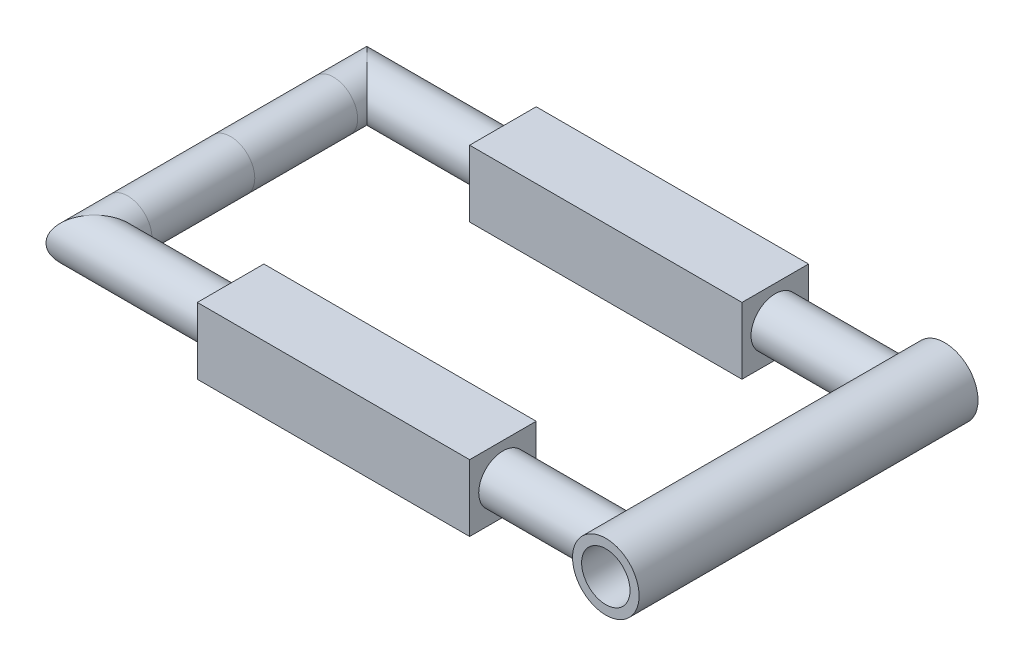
ISO-10303-21;
HEADER;
FILE_DESCRIPTION(('STEP AP214'),'2;1');
FILE_NAME('part.step','',(''),(''),'','','');
FILE_SCHEMA(('AUTOMOTIVE_DESIGN { 1 0 10303 214 1 1 1 1 }'));
ENDSEC;
DATA;
#1=APPLICATION_CONTEXT('core data for automotive mechanical design processes');
#2=APPLICATION_PROTOCOL_DEFINITION('international standard','automotive_design',2000,#1);
#3=PRODUCT_CONTEXT('',#1,'mechanical');
#4=PRODUCT('Part','Part','',(#3));
#5=PRODUCT_RELATED_PRODUCT_CATEGORY('part','',(#4));
#6=PRODUCT_DEFINITION_FORMATION('','',#4);
#7=PRODUCT_DEFINITION_CONTEXT('part definition',#1,'design');
#8=PRODUCT_DEFINITION('design','',#6,#7);
#9=PRODUCT_DEFINITION_SHAPE('','',#8);
#10=(LENGTH_UNIT() NAMED_UNIT(*) SI_UNIT(.MILLI.,.METRE.));
#11=(NAMED_UNIT(*) PLANE_ANGLE_UNIT() SI_UNIT($,.RADIAN.));
#12=(NAMED_UNIT(*) SI_UNIT($,.STERADIAN.) SOLID_ANGLE_UNIT());
#13=UNCERTAINTY_MEASURE_WITH_UNIT(LENGTH_MEASURE(1.E-05),#10,'distance_accuracy_value','');
#14=(GEOMETRIC_REPRESENTATION_CONTEXT(3) GLOBAL_UNCERTAINTY_ASSIGNED_CONTEXT((#13)) GLOBAL_UNIT_ASSIGNED_CONTEXT((#10,
#11,#12)) REPRESENTATION_CONTEXT('',''));
#15=CARTESIAN_POINT('',(0.,0.,0.));
#16=DIRECTION('',(0.,0.,1.));
#17=DIRECTION('',(1.,0.,0.));
#18=AXIS2_PLACEMENT_3D('',#15,#16,#17);
#19=CARTESIAN_POINT('',(-22.452,0.,114.3));
#20=DIRECTION('',(1.,0.,0.));
#21=DIRECTION('',(0.,0.,-1.));
#22=AXIS2_PLACEMENT_3D('',#19,#20,#21);
#23=CYLINDRICAL_SURFACE('',#22,20.32);
#24=CARTESIAN_POINT('',(0.,0.,114.3));
#25=DIRECTION('',(0.707106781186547,0.,0.707106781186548));
#26=DIRECTION('',(-0.707106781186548,0.,0.707106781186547));
#27=AXIS2_PLACEMENT_3D('',#24,#25,#26);
#28=ELLIPSE('',#27,28.7368195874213,20.32);
#29=CARTESIAN_POINT('',(-20.32,0.,134.62));
#30=VERTEX_POINT('',#29);
#31=EDGE_CURVE('E211',#30,#30,#28,.F.);
#32=ORIENTED_EDGE('',*,*,#31,.F.);
#33=EDGE_LOOP('',(#32));
#34=FACE_BOUND('',#33,.T.);
#35=CARTESIAN_POINT('',(114.3,0.,114.3));
#36=DIRECTION('',(1.,0.,0.));
#37=DIRECTION('',(0.,0.,-1.));
#38=AXIS2_PLACEMENT_3D('',#35,#36,#37);
#39=CIRCLE('',#38,20.32);
#40=CARTESIAN_POINT('',(114.3,0.,93.98));
#41=VERTEX_POINT('',#40);
#42=EDGE_CURVE('E199',#41,#41,#39,.T.);
#43=ORIENTED_EDGE('',*,*,#42,.F.);
#44=EDGE_LOOP('',(#43));
#45=FACE_BOUND('',#44,.T.);
#46=ADVANCED_FACE('F39',(#34,#45),#23,.T.);
#47=CARTESIAN_POINT('',(0.,0.,-136.752));
#48=DIRECTION('',(0.,0.,1.));
#49=DIRECTION('',(1.,0.,0.));
#50=AXIS2_PLACEMENT_3D('',#47,#48,#49);
#51=CYLINDRICAL_SURFACE('',#50,20.32);
#52=CARTESIAN_POINT('',(0.,0.,-114.3));
#53=DIRECTION('',(-0.707106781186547,0.,0.707106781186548));
#54=DIRECTION('',(-0.707106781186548,0.,-0.707106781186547));
#55=AXIS2_PLACEMENT_3D('',#52,#53,#54);
#56=ELLIPSE('',#55,28.7368195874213,20.32);
#57=CARTESIAN_POINT('',(-20.3200000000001,0.,-134.62));
#58=VERTEX_POINT('',#57);
#59=EDGE_CURVE('E200',#58,#58,#56,.F.);
#60=ORIENTED_EDGE('',*,*,#59,.F.);
#61=EDGE_LOOP('',(#60));
#62=FACE_BOUND('',#61,.T.);
#63=CARTESIAN_POINT('',(0.,0.,-86.36));
#64=DIRECTION('',(0.,0.,1.));
#65=DIRECTION('',(1.,0.,0.));
#66=AXIS2_PLACEMENT_3D('',#63,#64,#65);
#67=CIRCLE('',#66,20.32);
#68=CARTESIAN_POINT('',(20.32,0.,-86.36));
#69=VERTEX_POINT('',#68);
#70=EDGE_CURVE('E206',#69,#69,#67,.T.);
#71=ORIENTED_EDGE('',*,*,#70,.F.);
#72=EDGE_LOOP('',(#71));
#73=FACE_BOUND('',#72,.T.);
#74=ADVANCED_FACE('F226',(#62,#73),#51,.T.);
#75=CARTESIAN_POINT('',(0.,0.,-86.36));
#76=DIRECTION('',(0.,0.,1.));
#77=DIRECTION('',(1.,0.,0.));
#78=AXIS2_PLACEMENT_3D('',#75,#76,#77);
#79=CYLINDRICAL_SURFACE('',#78,20.32);
#80=CARTESIAN_POINT('',(0.,0.,0.));
#81=DIRECTION('',(0.,0.,1.));
#82=DIRECTION('',(1.,0.,0.));
#83=AXIS2_PLACEMENT_3D('',#80,#81,#82);
#84=CIRCLE('',#83,20.32);
#85=CARTESIAN_POINT('',(20.32,0.,0.));
#86=VERTEX_POINT('',#85);
#87=EDGE_CURVE('E210',#86,#86,#84,.T.);
#88=ORIENTED_EDGE('',*,*,#87,.F.);
#89=EDGE_LOOP('',(#88));
#90=FACE_BOUND('',#89,.T.);
#91=ORIENTED_EDGE('',*,*,#70,.T.);
#92=EDGE_LOOP('',(#91));
#93=FACE_BOUND('',#92,.T.);
#94=ADVANCED_FACE('F232',(#90,#93),#79,.T.);
#95=CARTESIAN_POINT('',(0.,0.,0.));
#96=DIRECTION('',(0.,0.,1.));
#97=DIRECTION('',(1.,0.,0.));
#98=AXIS2_PLACEMENT_3D('',#95,#96,#97);
#99=CYLINDRICAL_SURFACE('',#98,20.32);
#100=CARTESIAN_POINT('',(0.,0.,86.36));
#101=DIRECTION('',(0.,0.,1.));
#102=DIRECTION('',(1.,0.,0.));
#103=AXIS2_PLACEMENT_3D('',#100,#101,#102);
#104=CIRCLE('',#103,20.32);
#105=CARTESIAN_POINT('',(20.32,0.,86.36));
#106=VERTEX_POINT('',#105);
#107=EDGE_CURVE('E205',#106,#106,#104,.T.);
#108=ORIENTED_EDGE('',*,*,#107,.F.);
#109=EDGE_LOOP('',(#108));
#110=FACE_BOUND('',#109,.T.);
#111=ORIENTED_EDGE('',*,*,#87,.T.);
#112=EDGE_LOOP('',(#111));
#113=FACE_BOUND('',#112,.T.);
#114=ADVANCED_FACE('F248',(#110,#113),#99,.T.);
#115=CARTESIAN_POINT('',(0.,0.,86.36));
#116=DIRECTION('',(0.,0.,1.));
#117=DIRECTION('',(1.,0.,0.));
#118=AXIS2_PLACEMENT_3D('',#115,#116,#117);
#119=CYLINDRICAL_SURFACE('',#118,20.32);
#120=ORIENTED_EDGE('',*,*,#107,.T.);
#121=EDGE_LOOP('',(#120));
#122=FACE_BOUND('',#121,.T.);
#123=ORIENTED_EDGE('',*,*,#31,.T.);
#124=EDGE_LOOP('',(#123));
#125=FACE_BOUND('',#124,.T.);
#126=ADVANCED_FACE('F242',(#122,#125),#119,.T.);
#127=CARTESIAN_POINT('',(114.3,0.,-114.3));
#128=DIRECTION('',(-1.,0.,0.));
#129=DIRECTION('',(0.,0.,1.));
#130=AXIS2_PLACEMENT_3D('',#127,#128,#129);
#131=CYLINDRICAL_SURFACE('',#130,20.32);
#132=CARTESIAN_POINT('',(114.3,0.,-114.3));
#133=DIRECTION('',(-1.,0.,0.));
#134=DIRECTION('',(0.,0.,1.));
#135=AXIS2_PLACEMENT_3D('',#132,#133,#134);
#136=CIRCLE('',#135,20.32);
#137=CARTESIAN_POINT('',(114.3,0.,-93.98));
#138=VERTEX_POINT('',#137);
#139=EDGE_CURVE('E195',#138,#138,#136,.T.);
#140=ORIENTED_EDGE('',*,*,#139,.T.);
#141=EDGE_LOOP('',(#140));
#142=FACE_BOUND('',#141,.T.);
#143=ORIENTED_EDGE('',*,*,#59,.T.);
#144=EDGE_LOOP('',(#143));
#145=FACE_BOUND('',#144,.T.);
#146=ADVANCED_FACE('F238',(#142,#145),#131,.T.);
#147=CARTESIAN_POINT('',(342.9,-27.94,-142.24));
#148=DIRECTION('',(-1.,0.,0.));
#149=DIRECTION('',(0.,0.,1.));
#150=AXIS2_PLACEMENT_3D('',#147,#148,#149);
#151=PLANE('',#150);
#152=CARTESIAN_POINT('',(342.9,0.,-114.3));
#153=DIRECTION('',(-1.,0.,0.));
#154=DIRECTION('',(0.,0.,1.));
#155=AXIS2_PLACEMENT_3D('',#152,#153,#154);
#156=CIRCLE('',#155,20.32);
#157=CARTESIAN_POINT('',(342.9,0.,-93.98));
#158=VERTEX_POINT('',#157);
#159=EDGE_CURVE('E204',#158,#158,#156,.F.);
#160=ORIENTED_EDGE('',*,*,#159,.F.);
#161=EDGE_LOOP('',(#160));
#162=FACE_BOUND('',#161,.T.);
#163=DIRECTION('',(0.,1.,0.));
#164=VECTOR('',#163,1.);
#165=CARTESIAN_POINT('',(342.9,-27.94,-142.24));
#166=LINE('',#165,#164);
#167=CARTESIAN_POINT('',(342.9,-27.94,-142.24));
#168=VERTEX_POINT('',#167);
#169=CARTESIAN_POINT('',(342.9,27.94,-142.24));
#170=VERTEX_POINT('',#169);
#171=EDGE_CURVE('E183',#168,#170,#166,.T.);
#172=ORIENTED_EDGE('',*,*,#171,.T.);
#173=DIRECTION('',(0.,0.,1.));
#174=VECTOR('',#173,1.);
#175=CARTESIAN_POINT('',(342.9,27.94,-142.24));
#176=LINE('',#175,#174);
#177=CARTESIAN_POINT('',(342.9,27.94,-86.36));
#178=VERTEX_POINT('',#177);
#179=EDGE_CURVE('E157',#170,#178,#176,.T.);
#180=ORIENTED_EDGE('',*,*,#179,.T.);
#181=DIRECTION('',(0.,1.,0.));
#182=VECTOR('',#181,1.);
#183=CARTESIAN_POINT('',(342.9,-27.94,-86.36));
#184=LINE('',#183,#182);
#185=CARTESIAN_POINT('',(342.9,-27.94,-86.36));
#186=VERTEX_POINT('',#185);
#187=EDGE_CURVE('E192',#186,#178,#184,.T.);
#188=ORIENTED_EDGE('',*,*,#187,.F.);
#189=DIRECTION('',(0.,0.,1.));
#190=VECTOR('',#189,1.);
#191=CARTESIAN_POINT('',(342.9,-27.94,-142.24));
#192=LINE('',#191,#190);
#193=EDGE_CURVE('E173',#168,#186,#192,.T.);
#194=ORIENTED_EDGE('',*,*,#193,.F.);
#195=EDGE_LOOP('',(#172,#180,#188,#194));
#196=FACE_BOUND('',#195,.T.);
#197=ADVANCED_FACE('F228',(#162,#196),#151,.F.);
#198=CARTESIAN_POINT('',(342.9,-27.94,-86.36));
#199=DIRECTION('',(0.,0.,-1.));
#200=DIRECTION('',(-1.,0.,0.));
#201=AXIS2_PLACEMENT_3D('',#198,#199,#200);
#202=PLANE('',#201);
#203=ORIENTED_EDGE('',*,*,#187,.T.);
#204=DIRECTION('',(-1.,0.,0.));
#205=VECTOR('',#204,1.);
#206=CARTESIAN_POINT('',(342.9,27.94,-86.36));
#207=LINE('',#206,#205);
#208=CARTESIAN_POINT('',(114.3,27.94,-86.36));
#209=VERTEX_POINT('',#208);
#210=EDGE_CURVE('E161',#178,#209,#207,.T.);
#211=ORIENTED_EDGE('',*,*,#210,.T.);
#212=DIRECTION('',(0.,1.,0.));
#213=VECTOR('',#212,1.);
#214=CARTESIAN_POINT('',(114.3,-27.94,-86.36));
#215=LINE('',#214,#213);
#216=CARTESIAN_POINT('',(114.3,-27.94,-86.36));
#217=VERTEX_POINT('',#216);
#218=EDGE_CURVE('E189',#217,#209,#215,.T.);
#219=ORIENTED_EDGE('',*,*,#218,.F.);
#220=DIRECTION('',(-1.,0.,0.));
#221=VECTOR('',#220,1.);
#222=CARTESIAN_POINT('',(342.9,-27.94,-86.36));
#223=LINE('',#222,#221);
#224=EDGE_CURVE('E176',#186,#217,#223,.T.);
#225=ORIENTED_EDGE('',*,*,#224,.F.);
#226=EDGE_LOOP('',(#203,#211,#219,#225));
#227=FACE_BOUND('',#226,.T.);
#228=ADVANCED_FACE('F237',(#227),#202,.F.);
#229=CARTESIAN_POINT('',(114.3,-27.94,-114.3));
#230=DIRECTION('',(1.,0.,0.));
#231=DIRECTION('',(0.,0.,-1.));
#232=AXIS2_PLACEMENT_3D('',#229,#230,#231);
#233=PLANE('',#232);
#234=ORIENTED_EDGE('',*,*,#139,.F.);
#235=EDGE_LOOP('',(#234));
#236=FACE_BOUND('',#235,.T.);
#237=ORIENTED_EDGE('',*,*,#218,.T.);
#238=DIRECTION('',(0.,0.,1.));
#239=VECTOR('',#238,1.);
#240=CARTESIAN_POINT('',(114.3,27.94,-114.3));
#241=LINE('',#240,#239);
#242=CARTESIAN_POINT('',(114.3,27.94,-142.24));
#243=VERTEX_POINT('',#242);
#244=EDGE_CURVE('E165',#243,#209,#241,.T.);
#245=ORIENTED_EDGE('',*,*,#244,.F.);
#246=DIRECTION('',(0.,1.,0.));
#247=VECTOR('',#246,1.);
#248=CARTESIAN_POINT('',(114.3,-27.94,-142.24));
#249=LINE('',#248,#247);
#250=CARTESIAN_POINT('',(114.3,-27.94,-142.24));
#251=VERTEX_POINT('',#250);
#252=EDGE_CURVE('E186',#251,#243,#249,.T.);
#253=ORIENTED_EDGE('',*,*,#252,.F.);
#254=DIRECTION('',(0.,0.,1.));
#255=VECTOR('',#254,1.);
#256=CARTESIAN_POINT('',(114.3,-27.94,-114.3));
#257=LINE('',#256,#255);
#258=EDGE_CURVE('E65',#251,#217,#257,.T.);
#259=ORIENTED_EDGE('',*,*,#258,.T.);
#260=EDGE_LOOP('',(#237,#245,#253,#259));
#261=FACE_BOUND('',#260,.T.);
#262=ADVANCED_FACE('F287',(#236,#261),#233,.F.);
#263=CARTESIAN_POINT('',(114.3,-27.94,-142.24));
#264=DIRECTION('',(0.,0.,1.));
#265=DIRECTION('',(1.,0.,0.));
#266=AXIS2_PLACEMENT_3D('',#263,#264,#265);
#267=PLANE('',#266);
#268=ORIENTED_EDGE('',*,*,#252,.T.);
#269=DIRECTION('',(1.,0.,0.));
#270=VECTOR('',#269,1.);
#271=CARTESIAN_POINT('',(114.3,27.94,-142.24));
#272=LINE('',#271,#270);
#273=EDGE_CURVE('E169',#243,#170,#272,.T.);
#274=ORIENTED_EDGE('',*,*,#273,.T.);
#275=ORIENTED_EDGE('',*,*,#171,.F.);
#276=DIRECTION('',(1.,0.,0.));
#277=VECTOR('',#276,1.);
#278=CARTESIAN_POINT('',(114.3,-27.94,-142.24));
#279=LINE('',#278,#277);
#280=EDGE_CURVE('E60',#251,#168,#279,.T.);
#281=ORIENTED_EDGE('',*,*,#280,.F.);
#282=EDGE_LOOP('',(#268,#274,#275,#281));
#283=FACE_BOUND('',#282,.T.);
#284=ADVANCED_FACE('F297',(#283),#267,.F.);
#285=CARTESIAN_POINT('',(0.,-27.94,0.));
#286=DIRECTION('',(0.,-1.,0.));
#287=DIRECTION('',(0.,0.,-1.));
#288=AXIS2_PLACEMENT_3D('',#285,#286,#287);
#289=PLANE('',#288);
#290=ORIENTED_EDGE('',*,*,#193,.T.);
#291=ORIENTED_EDGE('',*,*,#224,.T.);
#292=ORIENTED_EDGE('',*,*,#258,.F.);
#293=ORIENTED_EDGE('',*,*,#280,.T.);
#294=EDGE_LOOP('',(#290,#291,#292,#293));
#295=FACE_BOUND('',#294,.T.);
#296=ADVANCED_FACE('F307',(#295),#289,.T.);
#297=CARTESIAN_POINT('',(0.,27.94,0.));
#298=DIRECTION('',(0.,-1.,0.));
#299=DIRECTION('',(0.,0.,-1.));
#300=AXIS2_PLACEMENT_3D('',#297,#298,#299);
#301=PLANE('',#300);
#302=ORIENTED_EDGE('',*,*,#179,.F.);
#303=ORIENTED_EDGE('',*,*,#273,.F.);
#304=ORIENTED_EDGE('',*,*,#244,.T.);
#305=ORIENTED_EDGE('',*,*,#210,.F.);
#306=EDGE_LOOP('',(#302,#303,#304,#305));
#307=FACE_BOUND('',#306,.T.);
#308=ADVANCED_FACE('F317',(#307),#301,.F.);
#309=CARTESIAN_POINT('',(114.3,-27.94,142.24));
#310=DIRECTION('',(0.,0.,1.));
#311=DIRECTION('',(1.,0.,0.));
#312=AXIS2_PLACEMENT_3D('',#309,#310,#311);
#313=PLANE('',#312);
#314=DIRECTION('',(0.,1.,0.));
#315=VECTOR('',#314,1.);
#316=CARTESIAN_POINT('',(342.9,-27.94,142.24));
#317=LINE('',#316,#315);
#318=CARTESIAN_POINT('',(342.9,-27.94,142.24));
#319=VERTEX_POINT('',#318);
#320=CARTESIAN_POINT('',(342.9,27.94,142.24));
#321=VERTEX_POINT('',#320);
#322=EDGE_CURVE('E122',#319,#321,#317,.T.);
#323=ORIENTED_EDGE('',*,*,#322,.T.);
#324=DIRECTION('',(1.,0.,0.));
#325=VECTOR('',#324,1.);
#326=CARTESIAN_POINT('',(114.3,27.94,142.24));
#327=LINE('',#326,#325);
#328=CARTESIAN_POINT('',(114.3,27.94,142.24));
#329=VERTEX_POINT('',#328);
#330=EDGE_CURVE('E130',#329,#321,#327,.T.);
#331=ORIENTED_EDGE('',*,*,#330,.F.);
#332=DIRECTION('',(0.,1.,0.));
#333=VECTOR('',#332,1.);
#334=CARTESIAN_POINT('',(114.3,-27.94,142.24));
#335=LINE('',#334,#333);
#336=CARTESIAN_POINT('',(114.3,-27.94,142.24));
#337=VERTEX_POINT('',#336);
#338=EDGE_CURVE('E113',#337,#329,#335,.T.);
#339=ORIENTED_EDGE('',*,*,#338,.F.);
#340=DIRECTION('',(1.,0.,0.));
#341=VECTOR('',#340,1.);
#342=CARTESIAN_POINT('',(114.3,-27.94,142.24));
#343=LINE('',#342,#341);
#344=EDGE_CURVE('E128',#337,#319,#343,.T.);
#345=ORIENTED_EDGE('',*,*,#344,.T.);
#346=EDGE_LOOP('',(#323,#331,#339,#345));
#347=FACE_BOUND('',#346,.T.);
#348=ADVANCED_FACE('F127',(#347),#313,.T.);
#349=CARTESIAN_POINT('',(114.3,-27.94,114.3));
#350=DIRECTION('',(-1.,0.,0.));
#351=DIRECTION('',(0.,0.,1.));
#352=AXIS2_PLACEMENT_3D('',#349,#350,#351);
#353=PLANE('',#352);
#354=ORIENTED_EDGE('',*,*,#42,.T.);
#355=EDGE_LOOP('',(#354));
#356=FACE_BOUND('',#355,.T.);
#357=ORIENTED_EDGE('',*,*,#338,.T.);
#358=DIRECTION('',(0.,0.,-1.));
#359=VECTOR('',#358,1.);
#360=CARTESIAN_POINT('',(114.3,27.94,114.3));
#361=LINE('',#360,#359);
#362=CARTESIAN_POINT('',(114.3,27.94,86.36));
#363=VERTEX_POINT('',#362);
#364=EDGE_CURVE('E139',#329,#363,#361,.T.);
#365=ORIENTED_EDGE('',*,*,#364,.T.);
#366=DIRECTION('',(0.,1.,0.));
#367=VECTOR('',#366,1.);
#368=CARTESIAN_POINT('',(114.3,-27.94,86.36));
#369=LINE('',#368,#367);
#370=CARTESIAN_POINT('',(114.3,-27.94,86.36));
#371=VERTEX_POINT('',#370);
#372=EDGE_CURVE('E115',#371,#363,#369,.T.);
#373=ORIENTED_EDGE('',*,*,#372,.F.);
#374=DIRECTION('',(0.,0.,-1.));
#375=VECTOR('',#374,1.);
#376=CARTESIAN_POINT('',(114.3,-27.94,114.3));
#377=LINE('',#376,#375);
#378=EDGE_CURVE('E109',#337,#371,#377,.T.);
#379=ORIENTED_EDGE('',*,*,#378,.F.);
#380=EDGE_LOOP('',(#357,#365,#373,#379));
#381=FACE_BOUND('',#380,.T.);
#382=ADVANCED_FACE('F111',(#356,#381),#353,.T.);
#383=CARTESIAN_POINT('',(342.9,-27.94,86.36));
#384=DIRECTION('',(0.,0.,-1.));
#385=DIRECTION('',(-1.,0.,0.));
#386=AXIS2_PLACEMENT_3D('',#383,#384,#385);
#387=PLANE('',#386);
#388=ORIENTED_EDGE('',*,*,#372,.T.);
#389=DIRECTION('',(-1.,0.,0.));
#390=VECTOR('',#389,1.);
#391=CARTESIAN_POINT('',(342.9,27.94,86.36));
#392=LINE('',#391,#390);
#393=CARTESIAN_POINT('',(342.9,27.94,86.36));
#394=VERTEX_POINT('',#393);
#395=EDGE_CURVE('E143',#394,#363,#392,.T.);
#396=ORIENTED_EDGE('',*,*,#395,.F.);
#397=DIRECTION('',(0.,1.,0.));
#398=VECTOR('',#397,1.);
#399=CARTESIAN_POINT('',(342.9,-27.94,86.36));
#400=LINE('',#399,#398);
#401=CARTESIAN_POINT('',(342.9,-27.94,86.36));
#402=VERTEX_POINT('',#401);
#403=EDGE_CURVE('E470',#402,#394,#400,.T.);
#404=ORIENTED_EDGE('',*,*,#403,.F.);
#405=DIRECTION('',(-1.,0.,0.));
#406=VECTOR('',#405,1.);
#407=CARTESIAN_POINT('',(342.9,-27.94,86.36));
#408=LINE('',#407,#406);
#409=EDGE_CURVE('E121',#402,#371,#408,.T.);
#410=ORIENTED_EDGE('',*,*,#409,.T.);
#411=EDGE_LOOP('',(#388,#396,#404,#410));
#412=FACE_BOUND('',#411,.T.);
#413=ADVANCED_FACE('F344',(#412),#387,.T.);
#414=CARTESIAN_POINT('',(342.9,-27.94,142.24));
#415=DIRECTION('',(1.,0.,0.));
#416=DIRECTION('',(0.,0.,-1.));
#417=AXIS2_PLACEMENT_3D('',#414,#415,#416);
#418=PLANE('',#417);
#419=CARTESIAN_POINT('',(342.9,0.,114.3));
#420=DIRECTION('',(1.,0.,0.));
#421=DIRECTION('',(0.,0.,-1.));
#422=AXIS2_PLACEMENT_3D('',#419,#420,#421);
#423=CIRCLE('',#422,20.32);
#424=CARTESIAN_POINT('',(342.9,0.,93.98));
#425=VERTEX_POINT('',#424);
#426=EDGE_CURVE('E132',#425,#425,#423,.F.);
#427=ORIENTED_EDGE('',*,*,#426,.T.);
#428=EDGE_LOOP('',(#427));
#429=FACE_BOUND('',#428,.T.);
#430=ORIENTED_EDGE('',*,*,#403,.T.);
#431=DIRECTION('',(0.,0.,-1.));
#432=VECTOR('',#431,1.);
#433=CARTESIAN_POINT('',(342.9,27.94,142.24));
#434=LINE('',#433,#432);
#435=EDGE_CURVE('E151',#321,#394,#434,.T.);
#436=ORIENTED_EDGE('',*,*,#435,.F.);
#437=ORIENTED_EDGE('',*,*,#322,.F.);
#438=DIRECTION('',(0.,0.,-1.));
#439=VECTOR('',#438,1.);
#440=CARTESIAN_POINT('',(342.9,-27.94,142.24));
#441=LINE('',#440,#439);
#442=EDGE_CURVE('E137',#319,#402,#441,.T.);
#443=ORIENTED_EDGE('',*,*,#442,.T.);
#444=EDGE_LOOP('',(#430,#436,#437,#443));
#445=FACE_BOUND('',#444,.T.);
#446=ADVANCED_FACE('F353',(#429,#445),#418,.T.);
#447=CARTESIAN_POINT('',(0.,-27.94,0.));
#448=DIRECTION('',(0.,1.,0.));
#449=DIRECTION('',(0.,0.,1.));
#450=AXIS2_PLACEMENT_3D('',#447,#448,#449);
#451=PLANE('',#450);
#452=ORIENTED_EDGE('',*,*,#344,.F.);
#453=ORIENTED_EDGE('',*,*,#378,.T.);
#454=ORIENTED_EDGE('',*,*,#409,.F.);
#455=ORIENTED_EDGE('',*,*,#442,.F.);
#456=EDGE_LOOP('',(#452,#453,#454,#455));
#457=FACE_BOUND('',#456,.T.);
#458=ADVANCED_FACE('F135',(#457),#451,.F.);
#459=CARTESIAN_POINT('',(0.,27.94,0.));
#460=DIRECTION('',(0.,1.,0.));
#461=DIRECTION('',(0.,0.,1.));
#462=AXIS2_PLACEMENT_3D('',#459,#460,#461);
#463=PLANE('',#462);
#464=ORIENTED_EDGE('',*,*,#330,.T.);
#465=ORIENTED_EDGE('',*,*,#435,.T.);
#466=ORIENTED_EDGE('',*,*,#395,.T.);
#467=ORIENTED_EDGE('',*,*,#364,.F.);
#468=EDGE_LOOP('',(#464,#465,#466,#467));
#469=FACE_BOUND('',#468,.T.);
#470=ADVANCED_FACE('F365',(#469),#463,.T.);
#471=CARTESIAN_POINT('',(479.652,0.,114.3));
#472=DIRECTION('',(-1.,0.,0.));
#473=DIRECTION('',(0.,0.,1.));
#474=AXIS2_PLACEMENT_3D('',#471,#472,#473);
#475=CYLINDRICAL_SURFACE('',#474,20.32);
#476=CARTESIAN_POINT('',(429.26,0.,134.62));
#477=CARTESIAN_POINT('',(429.260004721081,-0.49991456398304,134.619995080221));
#478=CARTESIAN_POINT('',(429.27345068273,-0.999977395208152,134.601517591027));
#479=CARTESIAN_POINT('',(429.326931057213,-1.99618720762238,134.527886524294));
#480=CARTESIAN_POINT('',(429.366982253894,-2.4923315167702,134.472709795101));
#481=CARTESIAN_POINT('',(429.472839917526,-3.47768027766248,134.326401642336));
#482=CARTESIAN_POINT('',(429.53870558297,-3.96686608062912,134.235187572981));
#483=CARTESIAN_POINT('',(429.694650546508,-4.93345998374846,134.018233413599));
#484=CARTESIAN_POINT('',(429.784726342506,-5.41086977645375,133.892498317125));
#485=CARTESIAN_POINT('',(429.986522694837,-6.34812576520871,133.609116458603));
#486=CARTESIAN_POINT('',(430.098110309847,-6.80806006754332,133.451665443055));
#487=CARTESIAN_POINT('',(430.341040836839,-7.71093407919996,133.106316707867));
#488=CARTESIAN_POINT('',(430.472384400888,-8.15387322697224,132.918417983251));
#489=CARTESIAN_POINT('',(430.75232108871,-9.02059776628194,132.51427328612));
#490=CARTESIAN_POINT('',(430.900904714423,-9.4443935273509,132.298042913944));
#491=CARTESIAN_POINT('',(431.21286539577,-10.2717055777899,131.839050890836));
#492=CARTESIAN_POINT('',(431.376244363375,-10.675219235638,131.596285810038));
#493=CARTESIAN_POINT('',(431.73060346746,-11.4965747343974,131.062824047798));
#494=CARTESIAN_POINT('',(431.922742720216,-11.9123887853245,130.769776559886));
#495=CARTESIAN_POINT('',(432.318141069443,-12.7176226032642,130.156252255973));
#496=CARTESIAN_POINT('',(432.521400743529,-13.1070409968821,129.835774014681));
#497=CARTESIAN_POINT('',(432.935886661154,-13.8593322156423,129.168572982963));
#498=CARTESIAN_POINT('',(433.147124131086,-14.222165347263,128.821812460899));
#499=CARTESIAN_POINT('',(433.573702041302,-14.9200854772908,128.103773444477));
#500=CARTESIAN_POINT('',(433.789042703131,-15.2551709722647,127.732493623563));
#501=CARTESIAN_POINT('',(434.261261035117,-15.958375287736,126.893133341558));
#502=CARTESIAN_POINT('',(434.518213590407,-16.3205725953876,126.42011175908));
#503=CARTESIAN_POINT('',(435.025648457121,-17.0036121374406,125.441623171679));
#504=CARTESIAN_POINT('',(435.276128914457,-17.3244426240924,124.936147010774));
#505=CARTESIAN_POINT('',(435.762336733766,-17.9225677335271,123.893975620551));
#506=CARTESIAN_POINT('',(435.998080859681,-18.1999123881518,123.357317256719));
#507=CARTESIAN_POINT('',(436.333696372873,-18.5814355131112,122.529513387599));
#508=CARTESIAN_POINT('',(436.442549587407,-18.70284160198,122.249830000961));
#509=CARTESIAN_POINT('',(436.653021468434,-18.9338233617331,121.6828491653));
#510=CARTESIAN_POINT('',(436.754638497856,-19.043396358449,121.395550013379));
#511=CARTESIAN_POINT('',(436.98237431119,-19.2854206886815,120.714536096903));
#512=CARTESIAN_POINT('',(437.105054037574,-19.4129577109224,120.317897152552));
#513=CARTESIAN_POINT('',(437.331353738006,-19.6445088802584,119.512592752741));
#514=CARTESIAN_POINT('',(437.434979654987,-19.7485303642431,119.103931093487));
#515=CARTESIAN_POINT('',(437.619556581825,-19.9315513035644,118.27677045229));
#516=CARTESIAN_POINT('',(437.700548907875,-20.0105963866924,117.858290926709));
#517=CARTESIAN_POINT('',(437.836940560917,-20.1426061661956,117.013066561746));
#518=CARTESIAN_POINT('',(437.892339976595,-20.1955709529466,116.586321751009));
#519=CARTESIAN_POINT('',(437.975411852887,-20.2746681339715,115.72438679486));
#520=CARTESIAN_POINT('',(438.002874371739,-20.3005973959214,115.289157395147));
#521=CARTESIAN_POINT('',(438.028016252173,-20.3243437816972,114.417076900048));
#522=CARTESIAN_POINT('',(438.025696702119,-20.3221619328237,113.980225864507));
#523=CARTESIAN_POINT('',(437.991379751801,-20.2897277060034,113.108476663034));
#524=CARTESIAN_POINT('',(437.959363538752,-20.2594575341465,112.673579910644));
#525=CARTESIAN_POINT('',(437.86716098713,-20.1714884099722,111.80959970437));
#526=CARTESIAN_POINT('',(437.806971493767,-20.1137863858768,111.38051690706));
#527=CARTESIAN_POINT('',(437.652654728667,-19.9639109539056,110.482255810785));
#528=CARTESIAN_POINT('',(437.55541786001,-19.8685335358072,110.014149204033));
#529=CARTESIAN_POINT('',(437.333829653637,-19.6469677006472,109.091917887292));
#530=CARTESIAN_POINT('',(437.209474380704,-19.5207748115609,108.637795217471));
#531=CARTESIAN_POINT('',(436.938386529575,-19.2392522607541,107.744598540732));
#532=CARTESIAN_POINT('',(436.79161155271,-19.0838672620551,107.305555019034));
#533=CARTESIAN_POINT('',(436.480709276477,-18.7458618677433,106.444488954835));
#534=CARTESIAN_POINT('',(436.316580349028,-18.5632389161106,106.022468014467));
#535=CARTESIAN_POINT('',(435.917965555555,-18.1063184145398,105.056775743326));
#536=CARTESIAN_POINT('',(435.678398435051,-17.8218583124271,104.519992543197));
#537=CARTESIAN_POINT('',(435.185552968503,-17.2093687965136,103.478485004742));
#538=CARTESIAN_POINT('',(434.932270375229,-16.8813258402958,102.973770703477));
#539=CARTESIAN_POINT('',(434.419798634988,-16.1831311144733,101.996771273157));
#540=CARTESIAN_POINT('',(434.160604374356,-15.8129416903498,101.524515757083));
#541=CARTESIAN_POINT('',(433.643614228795,-15.0319534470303,100.61415313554));
#542=CARTESIAN_POINT('',(433.385818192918,-14.6211591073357,100.176042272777));
#543=CARTESIAN_POINT('',(432.874788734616,-13.7544162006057,99.330377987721));
#544=CARTESIAN_POINT('',(432.621654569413,-13.2979612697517,98.9232823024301));
#545=CARTESIAN_POINT('',(432.129670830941,-12.3454298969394,98.1485384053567));
#546=CARTESIAN_POINT('',(431.89082275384,-11.849349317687,97.7808943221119));
#547=CARTESIAN_POINT('',(431.433993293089,-10.8200129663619,97.0891543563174));
#548=CARTESIAN_POINT('',(431.21597221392,-10.2868314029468,96.7649751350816));
#549=CARTESIAN_POINT('',(430.908857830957,-9.46075321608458,96.3140332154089));
#550=CARTESIAN_POINT('',(430.809814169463,-9.18103666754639,96.1696188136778));
#551=CARTESIAN_POINT('',(430.619026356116,-8.61308213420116,95.8930176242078));
#552=CARTESIAN_POINT('',(430.527284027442,-8.32484204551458,95.7608338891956));
#553=CARTESIAN_POINT('',(430.309141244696,-7.5980928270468,95.4480751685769));
#554=CARTESIAN_POINT('',(430.187607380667,-7.15473247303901,95.2752639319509));
#555=CARTESIAN_POINT('',(429.964634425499,-6.25254655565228,94.9599805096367));
#556=CARTESIAN_POINT('',(429.863190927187,-5.79372440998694,94.8175016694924));
#557=CARTESIAN_POINT('',(429.682430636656,-4.86327172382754,94.5646703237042));
#558=CARTESIAN_POINT('',(429.603102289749,-4.39164801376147,94.4543010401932));
#559=CARTESIAN_POINT('',(429.468200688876,-3.43840217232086,94.2671343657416));
#560=CARTESIAN_POINT('',(429.412628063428,-2.95677977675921,94.1903378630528));
#561=CARTESIAN_POINT('',(429.326336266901,-1.98523511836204,94.0712673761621));
#562=CARTESIAN_POINT('',(429.295709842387,-1.49528873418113,94.0291222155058));
#563=CARTESIAN_POINT('',(429.260378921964,-0.512689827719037,93.9805141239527));
#564=CARTESIAN_POINT('',(429.255674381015,-0.0200373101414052,93.974051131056));
#565=CARTESIAN_POINT('',(429.272299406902,0.964011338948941,93.9969135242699));
#566=CARTESIAN_POINT('',(429.293630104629,1.45540741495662,94.0262404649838));
#567=CARTESIAN_POINT('',(429.361821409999,2.4330002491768,94.1202073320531));
#568=CARTESIAN_POINT('',(429.408681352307,2.91919714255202,94.1848463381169));
#569=CARTESIAN_POINT('',(429.523505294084,3.85552230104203,94.3437981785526));
#570=CARTESIAN_POINT('',(429.590128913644,4.3061375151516,94.4362303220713));
#571=CARTESIAN_POINT('',(429.743822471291,5.19674046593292,94.6504186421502));
#572=CARTESIAN_POINT('',(429.830891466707,5.63672869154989,94.7721734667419));
#573=CARTESIAN_POINT('',(430.023877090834,6.50378723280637,95.0435839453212));
#574=CARTESIAN_POINT('',(430.129795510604,6.93085631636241,95.1932422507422));
#575=CARTESIAN_POINT('',(430.358650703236,7.77012216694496,95.5188859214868));
#576=CARTESIAN_POINT('',(430.481588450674,8.1823180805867,95.6948727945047));
#577=CARTESIAN_POINT('',(430.753405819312,9.02401268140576,96.0872896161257));
#578=CARTESIAN_POINT('',(430.903594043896,9.45208592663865,96.3058687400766));
#579=CARTESIAN_POINT('',(431.219031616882,10.2874817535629,96.7700680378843));
#580=CARTESIAN_POINT('',(431.384281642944,10.694803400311,97.0156894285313));
#581=CARTESIAN_POINT('',(431.727258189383,11.4878081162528,97.5322717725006));
#582=CARTESIAN_POINT('',(431.904990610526,11.8734807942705,97.803244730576));
#583=CARTESIAN_POINT('',(432.270173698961,12.6222388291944,98.3688456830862));
#584=CARTESIAN_POINT('',(432.457625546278,12.9853214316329,98.6634765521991));
#585=CARTESIAN_POINT('',(432.874420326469,13.7525843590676,99.3309478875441));
#586=CARTESIAN_POINT('',(433.105156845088,14.1521437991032,99.7082394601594));
#587=CARTESIAN_POINT('',(433.571726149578,14.9180901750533,100.492269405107));
#588=CARTESIAN_POINT('',(433.807559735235,15.2844718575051,100.899012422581));
#589=CARTESIAN_POINT('',(434.279521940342,15.9835308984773,101.740987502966));
#590=CARTESIAN_POINT('',(434.515650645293,16.3161812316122,102.176241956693));
#591=CARTESIAN_POINT('',(434.982545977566,16.9464472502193,103.074086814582));
#592=CARTESIAN_POINT('',(435.213313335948,17.2440677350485,103.536673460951));
#593=CARTESIAN_POINT('',(435.636255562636,17.7693040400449,104.431365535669));
#594=CARTESIAN_POINT('',(435.829732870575,18.0010341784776,104.860440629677));
#595=CARTESIAN_POINT('',(436.203021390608,18.4350864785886,105.73903961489));
#596=CARTESIAN_POINT('',(436.382832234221,18.6374078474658,106.188564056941));
#597=CARTESIAN_POINT('',(436.723083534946,19.0106068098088,107.106646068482));
#598=CARTESIAN_POINT('',(436.883556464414,19.1815373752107,107.575169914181));
#599=CARTESIAN_POINT('',(437.179509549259,19.4902373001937,108.530693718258));
#600=CARTESIAN_POINT('',(437.314997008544,19.6280163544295,109.017688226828));
#601=CARTESIAN_POINT('',(437.528986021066,19.8421907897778,109.901177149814));
#602=CARTESIAN_POINT('',(437.613476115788,19.9254156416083,110.294571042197));
#603=CARTESIAN_POINT('',(437.760467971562,20.0688509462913,111.089596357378));
#604=CARTESIAN_POINT('',(437.822972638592,20.1290644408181,111.491226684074));
#605=CARTESIAN_POINT('',(437.923568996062,20.2254217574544,112.299922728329));
#606=CARTESIAN_POINT('',(437.961690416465,20.2615948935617,112.706981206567));
#607=CARTESIAN_POINT('',(438.012064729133,20.3093073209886,113.524159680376));
#608=CARTESIAN_POINT('',(438.02431746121,20.3208464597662,113.934279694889));
#609=CARTESIAN_POINT('',(438.022419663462,20.3190554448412,114.755015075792));
#610=CARTESIAN_POINT('',(438.008229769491,20.3056882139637,115.165630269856));
#611=CARTESIAN_POINT('',(437.953986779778,20.2542822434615,115.983564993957));
#612=CARTESIAN_POINT('',(437.913933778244,20.2162435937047,116.390884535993));
#613=CARTESIAN_POINT('',(437.809546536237,20.1161407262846,117.199944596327));
#614=CARTESIAN_POINT('',(437.745179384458,20.0540439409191,117.601676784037));
#615=CARTESIAN_POINT('',(437.594595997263,19.9068526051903,118.39672488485));
#616=CARTESIAN_POINT('',(437.508376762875,19.8217548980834,118.790039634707));
#617=CARTESIAN_POINT('',(437.287755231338,19.6004436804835,119.684912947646));
#618=CARTESIAN_POINT('',(437.146676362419,19.4565558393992,120.182936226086));
#619=CARTESIAN_POINT('',(436.838812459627,19.1341384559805,121.159430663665));
#620=CARTESIAN_POINT('',(436.672018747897,18.9555972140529,121.637895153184));
#621=CARTESIAN_POINT('',(436.318881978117,18.565875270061,122.574558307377));
#622=CARTESIAN_POINT('',(436.132514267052,18.3546532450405,123.032730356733));
#623=CARTESIAN_POINT('',(435.746154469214,17.9015295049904,123.92752052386));
#624=CARTESIAN_POINT('',(435.546163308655,17.6596298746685,124.364140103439));
#625=CARTESIAN_POINT('',(435.131599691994,17.1389402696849,125.227985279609));
#626=CARTESIAN_POINT('',(434.916771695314,16.8592770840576,125.65456081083));
#627=CARTESIAN_POINT('',(434.482862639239,16.2698866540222,126.484090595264));
#628=CARTESIAN_POINT('',(434.263781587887,15.9601594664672,126.887044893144));
#629=CARTESIAN_POINT('',(433.82561817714,15.3112764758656,127.668819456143));
#630=CARTESIAN_POINT('',(433.606535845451,14.9721101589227,128.047631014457));
#631=CARTESIAN_POINT('',(433.172424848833,14.2650411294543,128.779989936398));
#632=CARTESIAN_POINT('',(432.957396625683,13.8971353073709,129.133534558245));
#633=CARTESIAN_POINT('',(432.489191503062,13.049976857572,129.888088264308));
#634=CARTESIAN_POINT('',(432.237899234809,12.5639191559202,130.282677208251));
#635=CARTESIAN_POINT('',(431.753480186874,11.5513326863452,131.029159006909));
#636=CARTESIAN_POINT('',(431.520357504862,11.0247948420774,131.381042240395));
#637=CARTESIAN_POINT('',(431.079008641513,9.9339439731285,132.037643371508));
#638=CARTESIAN_POINT('',(430.870757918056,9.36966905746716,132.342407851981));
#639=CARTESIAN_POINT('',(430.485284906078,8.20625218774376,132.900416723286));
#640=CARTESIAN_POINT('',(430.308046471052,7.60712859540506,133.153687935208));
#641=CARTESIAN_POINT('',(430.035689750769,6.55363076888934,133.539841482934));
#642=CARTESIAN_POINT('',(429.931554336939,6.10657201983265,133.686474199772));
#643=CARTESIAN_POINT('',(429.744111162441,5.19925008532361,133.949252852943));
#644=CARTESIAN_POINT('',(429.660802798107,4.73898728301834,134.065399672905));
#645=CARTESIAN_POINT('',(429.516910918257,3.80931657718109,134.26539571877));
#646=CARTESIAN_POINT('',(429.456267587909,3.33993623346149,134.34932997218));
#647=CARTESIAN_POINT('',(429.358713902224,2.39418248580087,134.484107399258));
#648=CARTESIAN_POINT('',(429.321790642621,1.91781302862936,134.534968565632));
#649=CARTESIAN_POINT('',(429.284767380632,1.20038726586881,134.585934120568));
#650=CARTESIAN_POINT('',(429.275486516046,0.96061441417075,134.59870165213));
#651=CARTESIAN_POINT('',(429.26310121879,0.480572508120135,134.615736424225));
#652=CARTESIAN_POINT('',(429.259997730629,0.240303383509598,134.620002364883));
#653=CARTESIAN_POINT('',(429.26,0.,134.62));
#654=B_SPLINE_CURVE_WITH_KNOTS('',3,(#476,#477,#478,#479,#480,#481,#482,#483,#484,#485,#486,
#487,#488,#489,#490,#491,#492,#493,#494,#495,#496,#497,#498,#499,#500,#501,#502,#503,#504,#505,
#506,#507,#508,#509,#510,#511,#512,#513,#514,#515,#516,#517,#518,#519,#520,#521,#522,#523,#524,
#525,#526,#527,#528,#529,#530,#531,#532,#533,#534,#535,#536,#537,#538,#539,#540,#541,#542,#543,
#544,#545,#546,#547,#548,#549,#550,#551,#552,#553,#554,#555,#556,#557,#558,#559,#560,#561,#562,
#563,#564,#565,#566,#567,#568,#569,#570,#571,#572,#573,#574,#575,#576,#577,#578,#579,#580,#581,
#582,#583,#584,#585,#586,#587,#588,#589,#590,#591,#592,#593,#594,#595,#596,#597,#598,#599,#600,
#601,#602,#603,#604,#605,#606,#607,#608,#609,#610,#611,#612,#613,#614,#615,#616,#617,#618,#619,
#620,#621,#622,#623,#624,#625,#626,#627,#628,#629,#630,#631,#632,#633,#634,#635,#636,#637,#638,
#639,#640,#641,#642,#643,#644,#645,#646,#647,#648,#649,#650,#651,#652,#653),.UNSPECIFIED.,.T.,
.F.,(4,2,2,2,2,2,2,2,2,2,2,2,2,2,2,2,2,2,2,2,2,2,2,2,2,2,2,2,2,2,2,2,2,2,2,2,2,2,2,2,2,2,2,2,2,
2,2,2,2,2,2,2,2,2,2,2,2,2,2,2,2,2,2,2,2,2,2,2,2,2,2,2,2,2,2,2,2,2,2,2,2,2,2,2,2,2,2,2,4),(0.,
1.49948350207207,2.99991384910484,4.50380535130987,6.00747942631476,7.50214270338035,
8.9968553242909,10.490748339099,11.984834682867,13.6146338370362,15.2445177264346,
16.8767875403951,18.5091457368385,20.4533981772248,22.3982015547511,24.3407506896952,
25.3116653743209,26.2827990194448,27.5846123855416,28.8860190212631,30.1850342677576,
31.4840450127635,32.7927470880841,34.1014013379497,35.410885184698,36.7205157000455,
38.1809335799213,39.6415635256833,41.1049907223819,42.5685553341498,44.5249437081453,
46.4819414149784,48.4407014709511,50.3992456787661,52.3826161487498,54.3661939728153,
56.3459124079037,57.3355881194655,58.3255101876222,59.7972827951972,61.2687321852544,
62.739411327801,64.2101293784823,65.6862907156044,67.1624494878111,68.6386723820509,
70.1148568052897,71.507725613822,72.9005302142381,74.293467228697,75.6864840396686,
77.195717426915,78.7050187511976,80.2150384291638,81.725241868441,83.5115243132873,
85.2980891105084,87.0860741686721,88.873813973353,90.4464305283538,92.0190894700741,
93.5890696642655,95.1585901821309,96.3900480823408,97.6213431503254,98.8511340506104,
100.080932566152,101.312563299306,102.544189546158,103.777488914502,105.01095763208,
106.620273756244,108.230134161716,109.842047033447,111.453850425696,113.112879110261,
114.771904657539,116.431525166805,118.091325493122,120.112425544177,122.133980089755,
124.15352311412,126.172011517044,127.616204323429,129.06035526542,130.500667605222,
131.940195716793,132.660870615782,133.381655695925),.UNSPECIFIED.);
#655=CARTESIAN_POINT('',(429.26,0.,134.62));
#656=VERTEX_POINT('',#655);
#657=EDGE_CURVE('E11',#656,#656,#654,.T.);
#658=ORIENTED_EDGE('',*,*,#657,.F.);
#659=EDGE_LOOP('',(#658));
#660=FACE_BOUND('',#659,.T.);
#661=ORIENTED_EDGE('',*,*,#426,.F.);
#662=EDGE_LOOP('',(#661));
#663=FACE_BOUND('',#662,.T.);
#664=ADVANCED_FACE('F374',(#660,#663),#475,.T.);
#665=CARTESIAN_POINT('',(342.9,0.,-114.3));
#666=DIRECTION('',(1.,0.,0.));
#667=DIRECTION('',(0.,0.,-1.));
#668=AXIS2_PLACEMENT_3D('',#665,#666,#667);
#669=CYLINDRICAL_SURFACE('',#668,20.32);
#670=CARTESIAN_POINT('',(429.26,0.,-134.62));
#671=CARTESIAN_POINT('',(429.260004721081,0.499914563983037,-134.619995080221));
#672=CARTESIAN_POINT('',(429.27345068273,0.999977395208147,-134.601517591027));
#673=CARTESIAN_POINT('',(429.326931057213,1.99618720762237,-134.527886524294));
#674=CARTESIAN_POINT('',(429.366982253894,2.49233151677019,-134.472709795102));
#675=CARTESIAN_POINT('',(429.472839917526,3.47768027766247,-134.326401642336));
#676=CARTESIAN_POINT('',(429.53870558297,3.96686608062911,-134.235187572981));
#677=CARTESIAN_POINT('',(429.694650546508,4.93345998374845,-134.018233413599));
#678=CARTESIAN_POINT('',(429.784726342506,5.41086977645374,-133.892498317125));
#679=CARTESIAN_POINT('',(429.986522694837,6.34812576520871,-133.609116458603));
#680=CARTESIAN_POINT('',(430.098110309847,6.80806006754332,-133.451665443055));
#681=CARTESIAN_POINT('',(430.341040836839,7.71093407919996,-133.106316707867));
#682=CARTESIAN_POINT('',(430.472384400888,8.15387322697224,-132.918417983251));
#683=CARTESIAN_POINT('',(430.75232108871,9.02059776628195,-132.51427328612));
#684=CARTESIAN_POINT('',(430.900904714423,9.44439352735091,-132.298042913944));
#685=CARTESIAN_POINT('',(431.21286539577,10.2717055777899,-131.839050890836));
#686=CARTESIAN_POINT('',(431.376244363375,10.675219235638,-131.596285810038));
#687=CARTESIAN_POINT('',(431.73060346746,11.4965747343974,-131.062824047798));
#688=CARTESIAN_POINT('',(431.922742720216,11.9123887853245,-130.769776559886));
#689=CARTESIAN_POINT('',(432.318141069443,12.7176226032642,-130.156252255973));
#690=CARTESIAN_POINT('',(432.521400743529,13.1070409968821,-129.835774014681));
#691=CARTESIAN_POINT('',(432.935886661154,13.8593322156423,-129.168572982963));
#692=CARTESIAN_POINT('',(433.147124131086,14.222165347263,-128.821812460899));
#693=CARTESIAN_POINT('',(433.573702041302,14.9200854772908,-128.103773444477));
#694=CARTESIAN_POINT('',(433.789042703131,15.2551709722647,-127.732493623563));
#695=CARTESIAN_POINT('',(434.261261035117,15.958375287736,-126.893133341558));
#696=CARTESIAN_POINT('',(434.518213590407,16.3205725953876,-126.42011175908));
#697=CARTESIAN_POINT('',(435.025648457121,17.0036121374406,-125.441623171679));
#698=CARTESIAN_POINT('',(435.276128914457,17.3244426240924,-124.936147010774));
#699=CARTESIAN_POINT('',(435.762336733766,17.9225677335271,-123.893975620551));
#700=CARTESIAN_POINT('',(435.998080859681,18.1999123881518,-123.357317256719));
#701=CARTESIAN_POINT('',(436.333696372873,18.5814355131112,-122.529513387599));
#702=CARTESIAN_POINT('',(436.442549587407,18.70284160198,-122.249830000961));
#703=CARTESIAN_POINT('',(436.653021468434,18.9338233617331,-121.6828491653));
#704=CARTESIAN_POINT('',(436.754638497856,19.043396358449,-121.395550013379));
#705=CARTESIAN_POINT('',(436.98237431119,19.2854206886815,-120.714536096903));
#706=CARTESIAN_POINT('',(437.105054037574,19.4129577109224,-120.317897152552));
#707=CARTESIAN_POINT('',(437.331353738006,19.6445088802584,-119.512592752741));
#708=CARTESIAN_POINT('',(437.434979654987,19.7485303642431,-119.103931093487));
#709=CARTESIAN_POINT('',(437.619556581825,19.9315513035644,-118.27677045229));
#710=CARTESIAN_POINT('',(437.700548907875,20.0105963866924,-117.858290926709));
#711=CARTESIAN_POINT('',(437.836940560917,20.1426061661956,-117.013066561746));
#712=CARTESIAN_POINT('',(437.892339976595,20.1955709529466,-116.586321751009));
#713=CARTESIAN_POINT('',(437.975411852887,20.2746681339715,-115.72438679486));
#714=CARTESIAN_POINT('',(438.002874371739,20.3005973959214,-115.289157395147));
#715=CARTESIAN_POINT('',(438.028016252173,20.3243437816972,-114.417076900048));
#716=CARTESIAN_POINT('',(438.025696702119,20.3221619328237,-113.980225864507));
#717=CARTESIAN_POINT('',(437.991379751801,20.2897277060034,-113.108476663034));
#718=CARTESIAN_POINT('',(437.959363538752,20.2594575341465,-112.673579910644));
#719=CARTESIAN_POINT('',(437.86716098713,20.1714884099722,-111.80959970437));
#720=CARTESIAN_POINT('',(437.806971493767,20.1137863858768,-111.38051690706));
#721=CARTESIAN_POINT('',(437.652654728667,19.9639109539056,-110.482255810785));
#722=CARTESIAN_POINT('',(437.55541786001,19.8685335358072,-110.014149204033));
#723=CARTESIAN_POINT('',(437.333829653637,19.6469677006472,-109.091917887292));
#724=CARTESIAN_POINT('',(437.209474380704,19.5207748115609,-108.637795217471));
#725=CARTESIAN_POINT('',(436.938386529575,19.2392522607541,-107.744598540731));
#726=CARTESIAN_POINT('',(436.79161155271,19.0838672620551,-107.305555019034));
#727=CARTESIAN_POINT('',(436.480709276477,18.7458618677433,-106.444488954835));
#728=CARTESIAN_POINT('',(436.316580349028,18.5632389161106,-106.022468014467));
#729=CARTESIAN_POINT('',(435.917965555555,18.1063184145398,-105.056775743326));
#730=CARTESIAN_POINT('',(435.678398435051,17.8218583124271,-104.519992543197));
#731=CARTESIAN_POINT('',(435.185552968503,17.2093687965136,-103.478485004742));
#732=CARTESIAN_POINT('',(434.932270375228,16.8813258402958,-102.973770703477));
#733=CARTESIAN_POINT('',(434.419798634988,16.1831311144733,-101.996771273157));
#734=CARTESIAN_POINT('',(434.160604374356,15.8129416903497,-101.524515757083));
#735=CARTESIAN_POINT('',(433.643614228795,15.0319534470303,-100.61415313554));
#736=CARTESIAN_POINT('',(433.385818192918,14.6211591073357,-100.176042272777));
#737=CARTESIAN_POINT('',(432.874788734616,13.7544162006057,-99.330377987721));
#738=CARTESIAN_POINT('',(432.621654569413,13.2979612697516,-98.9232823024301));
#739=CARTESIAN_POINT('',(432.129670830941,12.3454298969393,-98.1485384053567));
#740=CARTESIAN_POINT('',(431.89082275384,11.849349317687,-97.7808943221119));
#741=CARTESIAN_POINT('',(431.433993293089,10.8200129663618,-97.0891543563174));
#742=CARTESIAN_POINT('',(431.215972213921,10.2868314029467,-96.7649751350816));
#743=CARTESIAN_POINT('',(430.908857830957,9.46075321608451,-96.3140332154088));
#744=CARTESIAN_POINT('',(430.809814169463,9.18103666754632,-96.1696188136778));
#745=CARTESIAN_POINT('',(430.619026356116,8.61308213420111,-95.8930176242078));
#746=CARTESIAN_POINT('',(430.527284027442,8.32484204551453,-95.7608338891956));
#747=CARTESIAN_POINT('',(430.309141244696,7.59809282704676,-95.4480751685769));
#748=CARTESIAN_POINT('',(430.187607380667,7.15473247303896,-95.2752639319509));
#749=CARTESIAN_POINT('',(429.964634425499,6.25254655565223,-94.9599805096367));
#750=CARTESIAN_POINT('',(429.863190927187,5.7937244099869,-94.8175016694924));
#751=CARTESIAN_POINT('',(429.682430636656,4.86327172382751,-94.5646703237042));
#752=CARTESIAN_POINT('',(429.603102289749,4.39164801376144,-94.4543010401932));
#753=CARTESIAN_POINT('',(429.468200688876,3.43840217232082,-94.2671343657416));
#754=CARTESIAN_POINT('',(429.412628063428,2.95677977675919,-94.1903378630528));
#755=CARTESIAN_POINT('',(429.326336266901,1.98523511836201,-94.0712673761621));
#756=CARTESIAN_POINT('',(429.295709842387,1.4952887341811,-94.0291222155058));
#757=CARTESIAN_POINT('',(429.260378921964,0.512689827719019,-93.9805141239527));
#758=CARTESIAN_POINT('',(429.255674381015,0.0200373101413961,-93.9740511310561));
#759=CARTESIAN_POINT('',(429.272299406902,-0.964011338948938,-93.9969135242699));
#760=CARTESIAN_POINT('',(429.293630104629,-1.45540741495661,-94.0262404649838));
#761=CARTESIAN_POINT('',(429.361821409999,-2.43300024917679,-94.1202073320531));
#762=CARTESIAN_POINT('',(429.408681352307,-2.919197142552,-94.1848463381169));
#763=CARTESIAN_POINT('',(429.523505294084,-3.85552230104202,-94.3437981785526));
#764=CARTESIAN_POINT('',(429.590128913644,-4.30613751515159,-94.4362303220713));
#765=CARTESIAN_POINT('',(429.743822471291,-5.19674046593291,-94.6504186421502));
#766=CARTESIAN_POINT('',(429.830891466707,-5.63672869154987,-94.7721734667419));
#767=CARTESIAN_POINT('',(430.023877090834,-6.50378723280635,-95.0435839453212));
#768=CARTESIAN_POINT('',(430.129795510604,-6.93085631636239,-95.1932422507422));
#769=CARTESIAN_POINT('',(430.358650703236,-7.77012216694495,-95.5188859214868));
#770=CARTESIAN_POINT('',(430.481588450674,-8.18231808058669,-95.6948727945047));
#771=CARTESIAN_POINT('',(430.753405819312,-9.02401268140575,-96.0872896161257));
#772=CARTESIAN_POINT('',(430.903594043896,-9.45208592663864,-96.3058687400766));
#773=CARTESIAN_POINT('',(431.219031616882,-10.2874817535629,-96.7700680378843));
#774=CARTESIAN_POINT('',(431.384281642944,-10.694803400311,-97.0156894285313));
#775=CARTESIAN_POINT('',(431.727258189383,-11.4878081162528,-97.5322717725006));
#776=CARTESIAN_POINT('',(431.904990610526,-11.8734807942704,-97.803244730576));
#777=CARTESIAN_POINT('',(432.270173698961,-12.6222388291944,-98.3688456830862));
#778=CARTESIAN_POINT('',(432.457625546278,-12.9853214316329,-98.6634765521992));
#779=CARTESIAN_POINT('',(432.874420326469,-13.7525843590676,-99.3309478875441));
#780=CARTESIAN_POINT('',(433.105156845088,-14.1521437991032,-99.7082394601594));
#781=CARTESIAN_POINT('',(433.571726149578,-14.9180901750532,-100.492269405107));
#782=CARTESIAN_POINT('',(433.807559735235,-15.2844718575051,-100.899012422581));
#783=CARTESIAN_POINT('',(434.279521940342,-15.9835308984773,-101.740987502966));
#784=CARTESIAN_POINT('',(434.515650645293,-16.3161812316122,-102.176241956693));
#785=CARTESIAN_POINT('',(434.982545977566,-16.9464472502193,-103.074086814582));
#786=CARTESIAN_POINT('',(435.213313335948,-17.2440677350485,-103.536673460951));
#787=CARTESIAN_POINT('',(435.636255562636,-17.7693040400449,-104.431365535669));
#788=CARTESIAN_POINT('',(435.829732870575,-18.0010341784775,-104.860440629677));
#789=CARTESIAN_POINT('',(436.203021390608,-18.4350864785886,-105.73903961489));
#790=CARTESIAN_POINT('',(436.382832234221,-18.6374078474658,-106.188564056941));
#791=CARTESIAN_POINT('',(436.723083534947,-19.0106068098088,-107.106646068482));
#792=CARTESIAN_POINT('',(436.883556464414,-19.1815373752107,-107.575169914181));
#793=CARTESIAN_POINT('',(437.179509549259,-19.4902373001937,-108.530693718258));
#794=CARTESIAN_POINT('',(437.314997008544,-19.6280163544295,-109.017688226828));
#795=CARTESIAN_POINT('',(437.528986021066,-19.8421907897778,-109.901177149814));
#796=CARTESIAN_POINT('',(437.613476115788,-19.9254156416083,-110.294571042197));
#797=CARTESIAN_POINT('',(437.760467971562,-20.0688509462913,-111.089596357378));
#798=CARTESIAN_POINT('',(437.822972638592,-20.1290644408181,-111.491226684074));
#799=CARTESIAN_POINT('',(437.923568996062,-20.2254217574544,-112.299922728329));
#800=CARTESIAN_POINT('',(437.961690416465,-20.2615948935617,-112.706981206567));
#801=CARTESIAN_POINT('',(438.012064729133,-20.3093073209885,-113.524159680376));
#802=CARTESIAN_POINT('',(438.02431746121,-20.3208464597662,-113.934279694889));
#803=CARTESIAN_POINT('',(438.022419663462,-20.3190554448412,-114.755015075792));
#804=CARTESIAN_POINT('',(438.008229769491,-20.3056882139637,-115.165630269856));
#805=CARTESIAN_POINT('',(437.953986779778,-20.2542822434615,-115.983564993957));
#806=CARTESIAN_POINT('',(437.913933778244,-20.2162435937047,-116.390884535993));
#807=CARTESIAN_POINT('',(437.809546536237,-20.1161407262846,-117.199944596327));
#808=CARTESIAN_POINT('',(437.745179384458,-20.0540439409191,-117.601676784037));
#809=CARTESIAN_POINT('',(437.594595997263,-19.9068526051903,-118.39672488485));
#810=CARTESIAN_POINT('',(437.508376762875,-19.8217548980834,-118.790039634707));
#811=CARTESIAN_POINT('',(437.287755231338,-19.6004436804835,-119.684912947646));
#812=CARTESIAN_POINT('',(437.146676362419,-19.4565558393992,-120.182936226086));
#813=CARTESIAN_POINT('',(436.838812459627,-19.1341384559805,-121.159430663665));
#814=CARTESIAN_POINT('',(436.672018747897,-18.9555972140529,-121.637895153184));
#815=CARTESIAN_POINT('',(436.318881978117,-18.5658752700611,-122.574558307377));
#816=CARTESIAN_POINT('',(436.132514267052,-18.3546532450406,-123.032730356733));
#817=CARTESIAN_POINT('',(435.746154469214,-17.9015295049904,-123.92752052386));
#818=CARTESIAN_POINT('',(435.546163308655,-17.6596298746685,-124.364140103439));
#819=CARTESIAN_POINT('',(435.131599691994,-17.1389402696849,-125.227985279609));
#820=CARTESIAN_POINT('',(434.916771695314,-16.8592770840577,-125.65456081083));
#821=CARTESIAN_POINT('',(434.482862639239,-16.2698866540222,-126.484090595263));
#822=CARTESIAN_POINT('',(434.263781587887,-15.9601594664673,-126.887044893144));
#823=CARTESIAN_POINT('',(433.82561817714,-15.3112764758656,-127.668819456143));
#824=CARTESIAN_POINT('',(433.606535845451,-14.9721101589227,-128.047631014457));
#825=CARTESIAN_POINT('',(433.172424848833,-14.2650411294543,-128.779989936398));
#826=CARTESIAN_POINT('',(432.957396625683,-13.897135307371,-129.133534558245));
#827=CARTESIAN_POINT('',(432.489191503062,-13.0499768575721,-129.888088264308));
#828=CARTESIAN_POINT('',(432.237899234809,-12.5639191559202,-130.282677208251));
#829=CARTESIAN_POINT('',(431.753480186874,-11.5513326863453,-131.029159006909));
#830=CARTESIAN_POINT('',(431.520357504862,-11.0247948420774,-131.381042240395));
#831=CARTESIAN_POINT('',(431.079008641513,-9.93394397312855,-132.037643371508));
#832=CARTESIAN_POINT('',(430.870757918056,-9.36966905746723,-132.342407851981));
#833=CARTESIAN_POINT('',(430.485284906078,-8.20625218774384,-132.900416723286));
#834=CARTESIAN_POINT('',(430.308046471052,-7.60712859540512,-133.153687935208));
#835=CARTESIAN_POINT('',(430.035689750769,-6.55363076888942,-133.539841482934));
#836=CARTESIAN_POINT('',(429.931554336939,-6.10657201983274,-133.686474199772));
#837=CARTESIAN_POINT('',(429.744111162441,-5.19925008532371,-133.949252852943));
#838=CARTESIAN_POINT('',(429.660802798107,-4.73898728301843,-134.065399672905));
#839=CARTESIAN_POINT('',(429.516910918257,-3.80931657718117,-134.26539571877));
#840=CARTESIAN_POINT('',(429.456267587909,-3.33993623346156,-134.34932997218));
#841=CARTESIAN_POINT('',(429.358713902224,-2.39418248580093,-134.484107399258));
#842=CARTESIAN_POINT('',(429.321790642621,-1.91781302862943,-134.534968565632));
#843=CARTESIAN_POINT('',(429.284767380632,-1.20038726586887,-134.585934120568));
#844=CARTESIAN_POINT('',(429.275486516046,-0.960614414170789,-134.59870165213));
#845=CARTESIAN_POINT('',(429.26310121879,-0.48057250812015,-134.615736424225));
#846=CARTESIAN_POINT('',(429.259997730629,-0.240303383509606,-134.620002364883));
#847=CARTESIAN_POINT('',(429.26,0.,-134.62));
#848=B_SPLINE_CURVE_WITH_KNOTS('',3,(#670,#671,#672,#673,#674,#675,#676,#677,#678,#679,#680,
#681,#682,#683,#684,#685,#686,#687,#688,#689,#690,#691,#692,#693,#694,#695,#696,#697,#698,#699,
#700,#701,#702,#703,#704,#705,#706,#707,#708,#709,#710,#711,#712,#713,#714,#715,#716,#717,#718,
#719,#720,#721,#722,#723,#724,#725,#726,#727,#728,#729,#730,#731,#732,#733,#734,#735,#736,#737,
#738,#739,#740,#741,#742,#743,#744,#745,#746,#747,#748,#749,#750,#751,#752,#753,#754,#755,#756,
#757,#758,#759,#760,#761,#762,#763,#764,#765,#766,#767,#768,#769,#770,#771,#772,#773,#774,#775,
#776,#777,#778,#779,#780,#781,#782,#783,#784,#785,#786,#787,#788,#789,#790,#791,#792,#793,#794,
#795,#796,#797,#798,#799,#800,#801,#802,#803,#804,#805,#806,#807,#808,#809,#810,#811,#812,#813,
#814,#815,#816,#817,#818,#819,#820,#821,#822,#823,#824,#825,#826,#827,#828,#829,#830,#831,#832,
#833,#834,#835,#836,#837,#838,#839,#840,#841,#842,#843,#844,#845,#846,#847),.UNSPECIFIED.,.T.,
.F.,(4,2,2,2,2,2,2,2,2,2,2,2,2,2,2,2,2,2,2,2,2,2,2,2,2,2,2,2,2,2,2,2,2,2,2,2,2,2,2,2,2,2,2,2,2,
2,2,2,2,2,2,2,2,2,2,2,2,2,2,2,2,2,2,2,2,2,2,2,2,2,2,2,2,2,2,2,2,2,2,2,2,2,2,2,2,2,2,2,4),(0.,
1.49948350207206,2.99991384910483,4.50380535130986,6.00747942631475,7.50214270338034,
8.9968553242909,10.490748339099,11.984834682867,13.6146338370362,15.2445177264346,
16.8767875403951,18.5091457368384,20.4533981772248,22.3982015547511,24.3407506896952,
25.3116653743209,26.2827990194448,27.5846123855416,28.8860190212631,30.1850342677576,
31.4840450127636,32.7927470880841,34.1014013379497,35.410885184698,36.7205157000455,
38.1809335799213,39.6415635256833,41.1049907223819,42.5685553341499,44.5249437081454,
46.4819414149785,48.4407014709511,50.3992456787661,52.3826161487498,54.3661939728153,
56.3459124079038,57.3355881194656,58.3255101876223,59.7972827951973,61.2687321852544,
62.7394113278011,64.2101293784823,65.6862907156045,67.1624494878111,68.638672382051,
70.1148568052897,71.507725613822,72.9005302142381,74.293467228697,75.6864840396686,
77.1957174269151,78.7050187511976,80.2150384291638,81.725241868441,83.5115243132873,
85.2980891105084,87.0860741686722,88.873813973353,90.4464305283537,92.019089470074,
93.5890696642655,95.1585901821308,96.3900480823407,97.6213431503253,98.8511340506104,
100.080932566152,101.312563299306,102.544189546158,103.777488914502,105.01095763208,
106.620273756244,108.230134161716,109.842047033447,111.453850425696,113.112879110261,
114.771904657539,116.431525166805,118.091325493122,120.112425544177,122.133980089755,
124.153523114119,126.172011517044,127.616204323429,129.06035526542,130.500667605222,
131.940195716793,132.660870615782,133.381655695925),.UNSPECIFIED.);
#849=CARTESIAN_POINT('',(429.26,0.,-134.62));
#850=VERTEX_POINT('',#849);
#851=EDGE_CURVE('E42',#850,#850,#848,.T.);
#852=ORIENTED_EDGE('',*,*,#851,.F.);
#853=EDGE_LOOP('',(#852));
#854=FACE_BOUND('',#853,.T.);
#855=ORIENTED_EDGE('',*,*,#159,.T.);
#856=EDGE_LOOP('',(#855));
#857=FACE_BOUND('',#856,.T.);
#858=ADVANCED_FACE('F377',(#854,#857),#669,.T.);
#859=CARTESIAN_POINT('',(457.2,0.,-142.24));
#860=DIRECTION('',(0.,0.,1.));
#861=DIRECTION('',(1.,0.,0.));
#862=AXIS2_PLACEMENT_3D('',#859,#860,#861);
#863=CYLINDRICAL_SURFACE('',#862,27.9399999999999);
#864=ORIENTED_EDGE('',*,*,#657,.T.);
#865=EDGE_LOOP('',(#864));
#866=FACE_BOUND('',#865,.T.);
#867=ORIENTED_EDGE('',*,*,#851,.T.);
#868=EDGE_LOOP('',(#867));
#869=FACE_BOUND('',#868,.T.);
#870=CARTESIAN_POINT('',(457.2,0.,-142.24));
#871=DIRECTION('',(0.,0.,1.));
#872=DIRECTION('',(1.,0.,0.));
#873=AXIS2_PLACEMENT_3D('',#870,#871,#872);
#874=CIRCLE('',#873,27.9399999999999);
#875=CARTESIAN_POINT('',(485.14,0.,-142.24));
#876=VERTEX_POINT('',#875);
#877=EDGE_CURVE('E467',#876,#876,#874,.T.);
#878=ORIENTED_EDGE('',*,*,#877,.T.);
#879=EDGE_LOOP('',(#878));
#880=FACE_BOUND('',#879,.T.);
#881=CARTESIAN_POINT('',(457.2,0.,142.24));
#882=DIRECTION('',(0.,0.,1.));
#883=DIRECTION('',(1.,0.,0.));
#884=AXIS2_PLACEMENT_3D('',#881,#882,#883);
#885=CIRCLE('',#884,27.9399999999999);
#886=CARTESIAN_POINT('',(485.14,0.,142.24));
#887=VERTEX_POINT('',#886);
#888=EDGE_CURVE('E458',#887,#887,#885,.T.);
#889=ORIENTED_EDGE('',*,*,#888,.F.);
#890=EDGE_LOOP('',(#889));
#891=FACE_BOUND('',#890,.T.);
#892=ADVANCED_FACE('F399',(#866,#869,#880,#891),#863,.T.);
#893=CARTESIAN_POINT('',(457.2,0.,-142.24));
#894=DIRECTION('',(0.,0.,1.));
#895=DIRECTION('',(1.,0.,0.));
#896=AXIS2_PLACEMENT_3D('',#893,#894,#895);
#897=PLANE('',#896);
#898=CARTESIAN_POINT('',(457.2,0.,-142.24));
#899=DIRECTION('',(0.,0.,1.));
#900=DIRECTION('',(1.,0.,0.));
#901=AXIS2_PLACEMENT_3D('',#898,#899,#900);
#902=CIRCLE('',#901,20.32);
#903=CARTESIAN_POINT('',(477.52,0.,-142.24));
#904=VERTEX_POINT('',#903);
#905=EDGE_CURVE('E483',#904,#904,#902,.T.);
#906=ORIENTED_EDGE('',*,*,#905,.T.);
#907=EDGE_LOOP('',(#906));
#908=FACE_BOUND('',#907,.T.);
#909=ORIENTED_EDGE('',*,*,#877,.F.);
#910=EDGE_LOOP('',(#909));
#911=FACE_BOUND('',#910,.T.);
#912=ADVANCED_FACE('F415',(#908,#911),#897,.F.);
#913=CARTESIAN_POINT('',(457.2,0.,142.24));
#914=DIRECTION('',(0.,0.,1.));
#915=DIRECTION('',(1.,0.,0.));
#916=AXIS2_PLACEMENT_3D('',#913,#914,#915);
#917=PLANE('',#916);
#918=CARTESIAN_POINT('',(457.2,0.,142.24));
#919=DIRECTION('',(0.,0.,1.));
#920=DIRECTION('',(1.,0.,0.));
#921=AXIS2_PLACEMENT_3D('',#918,#919,#920);
#922=CIRCLE('',#921,20.32);
#923=CARTESIAN_POINT('',(477.52,0.,142.24));
#924=VERTEX_POINT('',#923);
#925=EDGE_CURVE('E486',#924,#924,#922,.T.);
#926=ORIENTED_EDGE('',*,*,#925,.F.);
#927=EDGE_LOOP('',(#926));
#928=FACE_BOUND('',#927,.T.);
#929=ORIENTED_EDGE('',*,*,#888,.T.);
#930=EDGE_LOOP('',(#929));
#931=FACE_BOUND('',#930,.T.);
#932=ADVANCED_FACE('F424',(#928,#931),#917,.T.);
#933=CARTESIAN_POINT('',(457.2,0.,-142.24));
#934=DIRECTION('',(0.,0.,1.));
#935=DIRECTION('',(1.,0.,0.));
#936=AXIS2_PLACEMENT_3D('',#933,#934,#935);
#937=CYLINDRICAL_SURFACE('',#936,20.32);
#938=ORIENTED_EDGE('',*,*,#905,.F.);
#939=EDGE_LOOP('',(#938));
#940=FACE_BOUND('',#939,.T.);
#941=ORIENTED_EDGE('',*,*,#925,.T.);
#942=EDGE_LOOP('',(#941));
#943=FACE_BOUND('',#942,.T.);
#944=ADVANCED_FACE('F434',(#940,#943),#937,.F.);
#945=CLOSED_SHELL('',(#46,#74,#94,#114,#126,#146,#197,#228,#262,#284,#296,#308,#348,#382,#413,
#446,#458,#470,#664,#858,#892,#912,#932,#944));
#946=MANIFOLD_SOLID_BREP('B2',#945);
#947=ADVANCED_BREP_SHAPE_REPRESENTATION('',(#18,#946),#14);
#948=SHAPE_DEFINITION_REPRESENTATION(#9,#947);
ENDSEC;
END-ISO-10303-21;
